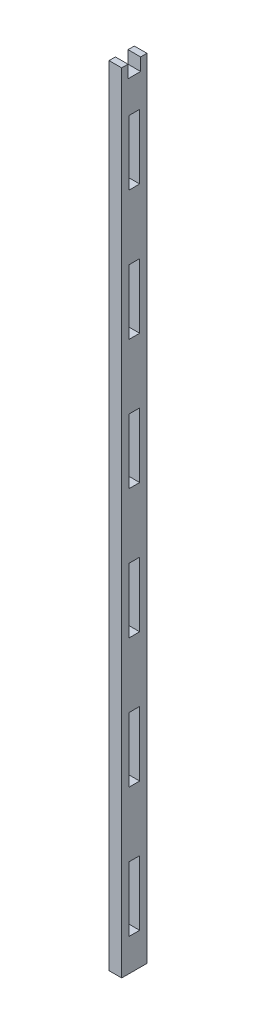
from build123d import *

# Parameters (mm, degrees)
SKETCH1_W           = 6.35
SKETCH1_H           = 198.4375
BOSS_EXTRUDE1_DEPTH = 3.175
SKETCH2_W           = 3.175
SKETCH2_H           = 6.35
CUT_EXTRUDE1_DEPTH  = 199.564459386
SKETCH3_W           = 2.696269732
SKETCH3_H           = 16.271875
CUT_EXTRUDE2_DEPTH  = 199.564459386
LPATTERN1_COUNT     = 6
LPATTERN1_PITCH     = 32.54375


with BuildPart() as part:
    # Sketch1 → Boss-Extrude1 (new body)
    with BuildSketch(Plane(origin=(0, 0, 0), x_dir=(0, 0, -1), z_dir=(1, 0, 0))):
        with Locations((3.175, 99.21875)):
            Rectangle(SKETCH1_W, SKETCH1_H)
    extrude(amount=BOSS_EXTRUDE1_DEPTH)

    # Sketch2 → Cut-Extrude1 (cut, through all)
    with BuildSketch(Plane(origin=(3.175, 0, 0), x_dir=(0, 0, -1), z_dir=(1, 0, 0))):
        with Locations((3.175, 198.4375)):
            Rectangle(SKETCH2_W, SKETCH2_H)
    extrude(amount=-CUT_EXTRUDE1_DEPTH, mode=Mode.SUBTRACT)

    # Sketch3 → Cut-Extrude2 (cut, through all)
    with BuildSketch(Plane(origin=(3.175, 0, 0), x_dir=(0, 0, -1), z_dir=(1, 0, 0))):
        with Locations((3.175, 16.271875)):
            Rectangle(SKETCH3_W, SKETCH3_H)
    cut_extrude2 = extrude(amount=-CUT_EXTRUDE2_DEPTH, mode=Mode.SUBTRACT)

    # LPattern1: Cut-Extrude2 ×6
    with Locations(*[(0, i * LPATTERN1_PITCH, 0) for i in range(1, LPATTERN1_COUNT)]):
        add(cut_extrude2, mode=Mode.SUBTRACT)


solid = part.part
